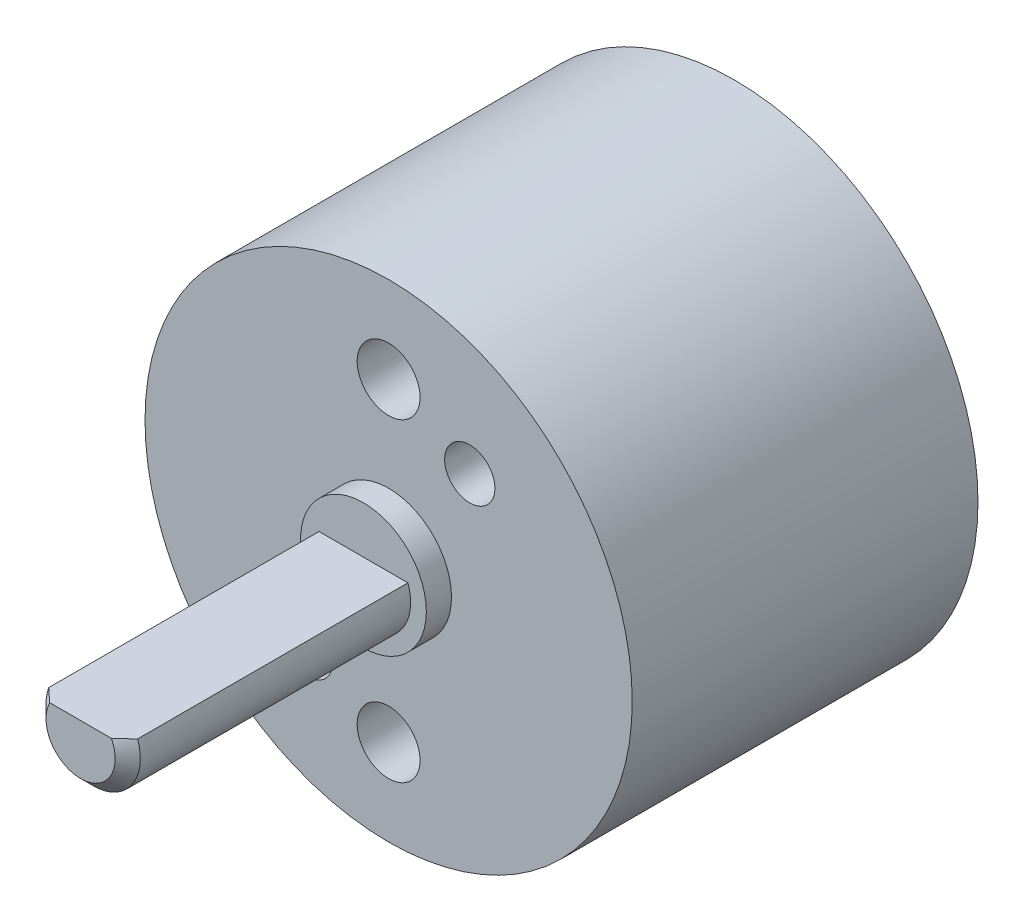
ISO-10303-21;
HEADER;
FILE_DESCRIPTION(('STEP AP214'),'2;1');
FILE_NAME('part.step','',(''),(''),'','','');
FILE_SCHEMA(('AUTOMOTIVE_DESIGN { 1 0 10303 214 1 1 1 1 }'));
ENDSEC;
DATA;
#1=APPLICATION_CONTEXT('core data for automotive mechanical design processes');
#2=APPLICATION_PROTOCOL_DEFINITION('international standard','automotive_design',2000,#1);
#3=PRODUCT_CONTEXT('',#1,'mechanical');
#4=PRODUCT('Part','Part','',(#3));
#5=PRODUCT_RELATED_PRODUCT_CATEGORY('part','',(#4));
#6=PRODUCT_DEFINITION_FORMATION('','',#4);
#7=PRODUCT_DEFINITION_CONTEXT('part definition',#1,'design');
#8=PRODUCT_DEFINITION('design','',#6,#7);
#9=PRODUCT_DEFINITION_SHAPE('','',#8);
#10=(LENGTH_UNIT() NAMED_UNIT(*) SI_UNIT(.MILLI.,.METRE.));
#11=(NAMED_UNIT(*) PLANE_ANGLE_UNIT() SI_UNIT($,.RADIAN.));
#12=(NAMED_UNIT(*) SI_UNIT($,.STERADIAN.) SOLID_ANGLE_UNIT());
#13=UNCERTAINTY_MEASURE_WITH_UNIT(LENGTH_MEASURE(1.E-05),#10,'distance_accuracy_value','');
#14=(GEOMETRIC_REPRESENTATION_CONTEXT(3) GLOBAL_UNCERTAINTY_ASSIGNED_CONTEXT((#13)) GLOBAL_UNIT_ASSIGNED_CONTEXT((#10,
#11,#12)) REPRESENTATION_CONTEXT('',''));
#15=CARTESIAN_POINT('',(0.,0.,0.));
#16=DIRECTION('',(0.,0.,1.));
#17=DIRECTION('',(1.,0.,0.));
#18=AXIS2_PLACEMENT_3D('',#15,#16,#17);
#19=CARTESIAN_POINT('',(0.,0.,11.));
#20=DIRECTION('',(0.,0.,-1.));
#21=DIRECTION('',(-1.,0.,0.));
#22=AXIS2_PLACEMENT_3D('',#19,#20,#21);
#23=CYLINDRICAL_SURFACE('',#22,7.75);
#24=CARTESIAN_POINT('',(0.,0.,11.));
#25=DIRECTION('',(0.,0.,1.));
#26=DIRECTION('',(1.,0.,0.));
#27=AXIS2_PLACEMENT_3D('',#24,#25,#26);
#28=CIRCLE('',#27,7.75);
#29=CARTESIAN_POINT('',(7.75,0.,11.));
#30=VERTEX_POINT('',#29);
#31=EDGE_CURVE('E112',#30,#30,#28,.T.);
#32=ORIENTED_EDGE('',*,*,#31,.F.);
#33=EDGE_LOOP('',(#32));
#34=FACE_BOUND('',#33,.T.);
#35=CARTESIAN_POINT('',(0.,0.,0.));
#36=DIRECTION('',(0.,0.,1.));
#37=DIRECTION('',(1.,0.,0.));
#38=AXIS2_PLACEMENT_3D('',#35,#36,#37);
#39=CIRCLE('',#38,7.75);
#40=CARTESIAN_POINT('',(7.75,0.,0.));
#41=VERTEX_POINT('',#40);
#42=EDGE_CURVE('E109',#41,#41,#39,.T.);
#43=ORIENTED_EDGE('',*,*,#42,.T.);
#44=EDGE_LOOP('',(#43));
#45=FACE_BOUND('',#44,.T.);
#46=ADVANCED_FACE('F18',(#34,#45),#23,.T.);
#47=CARTESIAN_POINT('',(0.,0.,11.));
#48=DIRECTION('',(0.,0.,1.));
#49=DIRECTION('',(1.,0.,0.));
#50=AXIS2_PLACEMENT_3D('',#47,#48,#49);
#51=PLANE('',#50);
#52=CARTESIAN_POINT('',(2.58109396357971,3.68618419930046,11.));
#53=DIRECTION('',(0.,0.,1.));
#54=DIRECTION('',(1.,0.,0.));
#55=AXIS2_PLACEMENT_3D('',#52,#53,#54);
#56=CIRCLE('',#55,0.79999999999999);
#57=CARTESIAN_POINT('',(3.3810939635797,3.68618419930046,11.));
#58=VERTEX_POINT('',#57);
#59=EDGE_CURVE('E71',#58,#58,#56,.T.);
#60=ORIENTED_EDGE('',*,*,#59,.F.);
#61=EDGE_LOOP('',(#60));
#62=FACE_BOUND('',#61,.T.);
#63=CARTESIAN_POINT('',(-2.58109396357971,-3.68618419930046,11.));
#64=DIRECTION('',(0.,0.,1.));
#65=DIRECTION('',(1.,0.,0.));
#66=AXIS2_PLACEMENT_3D('',#63,#64,#65);
#67=CIRCLE('',#66,0.79999999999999);
#68=CARTESIAN_POINT('',(-1.78109396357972,-3.68618419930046,11.));
#69=VERTEX_POINT('',#68);
#70=EDGE_CURVE('E70',#69,#69,#67,.T.);
#71=ORIENTED_EDGE('',*,*,#70,.F.);
#72=EDGE_LOOP('',(#71));
#73=FACE_BOUND('',#72,.T.);
#74=CARTESIAN_POINT('',(0.,-5.,11.));
#75=DIRECTION('',(0.,0.,1.));
#76=DIRECTION('',(1.,0.,0.));
#77=AXIS2_PLACEMENT_3D('',#74,#75,#76);
#78=CIRCLE('',#77,1.);
#79=CARTESIAN_POINT('',(1.,-5.,11.));
#80=VERTEX_POINT('',#79);
#81=EDGE_CURVE('E83',#80,#80,#78,.T.);
#82=ORIENTED_EDGE('',*,*,#81,.F.);
#83=EDGE_LOOP('',(#82));
#84=FACE_BOUND('',#83,.T.);
#85=CARTESIAN_POINT('',(0.,5.,11.));
#86=DIRECTION('',(0.,0.,1.));
#87=DIRECTION('',(1.,0.,0.));
#88=AXIS2_PLACEMENT_3D('',#85,#86,#87);
#89=CIRCLE('',#88,1.);
#90=CARTESIAN_POINT('',(0.999999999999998,5.,11.));
#91=VERTEX_POINT('',#90);
#92=EDGE_CURVE('E87',#91,#91,#89,.T.);
#93=ORIENTED_EDGE('',*,*,#92,.F.);
#94=EDGE_LOOP('',(#93));
#95=FACE_BOUND('',#94,.T.);
#96=CARTESIAN_POINT('',(0.,0.,11.));
#97=DIRECTION('',(0.,0.,1.));
#98=DIRECTION('',(1.,0.,0.));
#99=AXIS2_PLACEMENT_3D('',#96,#97,#98);
#100=CIRCLE('',#99,2.);
#101=CARTESIAN_POINT('',(2.,0.,11.));
#102=VERTEX_POINT('',#101);
#103=EDGE_CURVE('E105',#102,#102,#100,.T.);
#104=ORIENTED_EDGE('',*,*,#103,.F.);
#105=EDGE_LOOP('',(#104));
#106=FACE_BOUND('',#105,.T.);
#107=ORIENTED_EDGE('',*,*,#31,.T.);
#108=EDGE_LOOP('',(#107));
#109=FACE_BOUND('',#108,.T.);
#110=ADVANCED_FACE('F142',(#62,#73,#84,#95,#106,#109),#51,.T.);
#111=CARTESIAN_POINT('',(0.,0.,0.));
#112=DIRECTION('',(0.,0.,1.));
#113=DIRECTION('',(1.,0.,0.));
#114=AXIS2_PLACEMENT_3D('',#111,#112,#113);
#115=PLANE('',#114);
#116=CARTESIAN_POINT('',(0.,0.,0.));
#117=DIRECTION('',(0.,0.,-1.));
#118=DIRECTION('',(-1.,0.,0.));
#119=AXIS2_PLACEMENT_3D('',#116,#117,#118);
#120=CIRCLE('',#119,2.3);
#121=CARTESIAN_POINT('',(-2.3,0.,0.));
#122=VERTEX_POINT('',#121);
#123=EDGE_CURVE('E735',#122,#122,#120,.T.);
#124=ORIENTED_EDGE('',*,*,#123,.F.);
#125=EDGE_LOOP('',(#124));
#126=FACE_BOUND('',#125,.T.);
#127=CARTESIAN_POINT('',(0.,-5.,0.));
#128=DIRECTION('',(0.,0.,1.));
#129=DIRECTION('',(1.,0.,0.));
#130=AXIS2_PLACEMENT_3D('',#127,#128,#129);
#131=CIRCLE('',#130,1.);
#132=CARTESIAN_POINT('',(1.,-5.,0.));
#133=VERTEX_POINT('',#132);
#134=EDGE_CURVE('E84',#133,#133,#131,.T.);
#135=ORIENTED_EDGE('',*,*,#134,.T.);
#136=EDGE_LOOP('',(#135));
#137=FACE_BOUND('',#136,.T.);
#138=CARTESIAN_POINT('',(0.,5.,0.));
#139=DIRECTION('',(0.,0.,1.));
#140=DIRECTION('',(1.,0.,0.));
#141=AXIS2_PLACEMENT_3D('',#138,#139,#140);
#142=CIRCLE('',#141,1.);
#143=CARTESIAN_POINT('',(0.999999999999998,5.,0.));
#144=VERTEX_POINT('',#143);
#145=EDGE_CURVE('E90',#144,#144,#142,.T.);
#146=ORIENTED_EDGE('',*,*,#145,.T.);
#147=EDGE_LOOP('',(#146));
#148=FACE_BOUND('',#147,.T.);
#149=ORIENTED_EDGE('',*,*,#42,.F.);
#150=EDGE_LOOP('',(#149));
#151=FACE_BOUND('',#150,.T.);
#152=ADVANCED_FACE('F148',(#126,#137,#148,#151),#115,.F.);
#153=CARTESIAN_POINT('',(0.,0.,11.8));
#154=DIRECTION('',(0.,0.,-1.));
#155=DIRECTION('',(-1.,0.,0.));
#156=AXIS2_PLACEMENT_3D('',#153,#154,#155);
#157=CYLINDRICAL_SURFACE('',#156,2.);
#158=CARTESIAN_POINT('',(0.,0.,11.8));
#159=DIRECTION('',(0.,0.,1.));
#160=DIRECTION('',(1.,0.,0.));
#161=AXIS2_PLACEMENT_3D('',#158,#159,#160);
#162=CIRCLE('',#161,2.);
#163=CARTESIAN_POINT('',(2.,0.,11.8));
#164=VERTEX_POINT('',#163);
#165=EDGE_CURVE('E106',#164,#164,#162,.T.);
#166=ORIENTED_EDGE('',*,*,#165,.F.);
#167=EDGE_LOOP('',(#166));
#168=FACE_BOUND('',#167,.T.);
#169=ORIENTED_EDGE('',*,*,#103,.T.);
#170=EDGE_LOOP('',(#169));
#171=FACE_BOUND('',#170,.T.);
#172=ADVANCED_FACE('F155',(#168,#171),#157,.T.);
#173=CARTESIAN_POINT('',(0.,0.,11.8));
#174=DIRECTION('',(0.,0.,1.));
#175=DIRECTION('',(1.,0.,0.));
#176=AXIS2_PLACEMENT_3D('',#173,#174,#175);
#177=PLANE('',#176);
#178=CARTESIAN_POINT('',(0.,0.,11.8));
#179=DIRECTION('',(0.,0.,1.));
#180=DIRECTION('',(1.,0.,0.));
#181=AXIS2_PLACEMENT_3D('',#178,#179,#180);
#182=CIRCLE('',#181,1.5);
#183=CARTESIAN_POINT('',(-1.41421356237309,0.5,11.8));
#184=VERTEX_POINT('',#183);
#185=CARTESIAN_POINT('',(1.41421356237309,0.5,11.8));
#186=VERTEX_POINT('',#185);
#187=EDGE_CURVE('E102',#184,#186,#182,.T.);
#188=ORIENTED_EDGE('',*,*,#187,.F.);
#189=DIRECTION('',(-1.,0.,0.));
#190=VECTOR('',#189,1.);
#191=CARTESIAN_POINT('',(-2.24988252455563,0.5,11.8));
#192=LINE('',#191,#190);
#193=EDGE_CURVE('E96',#186,#184,#192,.T.);
#194=ORIENTED_EDGE('',*,*,#193,.F.);
#195=EDGE_LOOP('',(#188,#194));
#196=FACE_BOUND('',#195,.T.);
#197=ORIENTED_EDGE('',*,*,#165,.T.);
#198=EDGE_LOOP('',(#197));
#199=FACE_BOUND('',#198,.T.);
#200=ADVANCED_FACE('F139',(#196,#199),#177,.T.);
#201=CARTESIAN_POINT('',(0.,0.,20.8));
#202=DIRECTION('',(0.,0.,-1.));
#203=DIRECTION('',(-1.,0.,0.));
#204=AXIS2_PLACEMENT_3D('',#201,#202,#203);
#205=CYLINDRICAL_SURFACE('',#204,1.5);
#206=CARTESIAN_POINT('',(0.,0.,20.4));
#207=DIRECTION('',(0.,0.,1.));
#208=DIRECTION('',(1.,0.,0.));
#209=AXIS2_PLACEMENT_3D('',#206,#207,#208);
#210=CIRCLE('',#209,1.5);
#211=CARTESIAN_POINT('',(1.4142135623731,0.5,20.4));
#212=VERTEX_POINT('',#211);
#213=CARTESIAN_POINT('',(-1.41421356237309,0.5,20.4));
#214=VERTEX_POINT('',#213);
#215=EDGE_CURVE('E119',#212,#214,#210,.F.);
#216=ORIENTED_EDGE('',*,*,#215,.T.);
#217=DIRECTION('',(0.,0.,-1.));
#218=VECTOR('',#217,1.);
#219=CARTESIAN_POINT('',(-1.41421356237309,0.5,20.8));
#220=LINE('',#219,#218);
#221=EDGE_CURVE('E43',#214,#184,#220,.T.);
#222=ORIENTED_EDGE('',*,*,#221,.T.);
#223=ORIENTED_EDGE('',*,*,#187,.T.);
#224=DIRECTION('',(0.,0.,-1.));
#225=VECTOR('',#224,1.);
#226=CARTESIAN_POINT('',(1.41421356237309,0.5,20.8));
#227=LINE('',#226,#225);
#228=EDGE_CURVE('E98',#186,#212,#227,.F.);
#229=ORIENTED_EDGE('',*,*,#228,.T.);
#230=EDGE_LOOP('',(#216,#222,#223,#229));
#231=FACE_BOUND('',#230,.T.);
#232=ADVANCED_FACE('F127',(#231),#205,.T.);
#233=CARTESIAN_POINT('',(0.,0.,20.8));
#234=DIRECTION('',(0.,0.,1.));
#235=DIRECTION('',(1.,0.,0.));
#236=AXIS2_PLACEMENT_3D('',#233,#234,#235);
#237=PLANE('',#236);
#238=DIRECTION('',(1.,0.,0.));
#239=VECTOR('',#238,1.);
#240=CARTESIAN_POINT('',(-2.24988252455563,0.5,20.8));
#241=LINE('',#240,#239);
#242=CARTESIAN_POINT('',(-0.979795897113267,0.5,20.8));
#243=VERTEX_POINT('',#242);
#244=CARTESIAN_POINT('',(0.979795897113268,0.5,20.8));
#245=VERTEX_POINT('',#244);
#246=EDGE_CURVE('E37',#243,#245,#241,.T.);
#247=ORIENTED_EDGE('',*,*,#246,.F.);
#248=CARTESIAN_POINT('',(0.,0.,20.8));
#249=DIRECTION('',(0.,0.,1.));
#250=DIRECTION('',(1.,0.,0.));
#251=AXIS2_PLACEMENT_3D('',#248,#249,#250);
#252=CIRCLE('',#251,1.1);
#253=EDGE_CURVE('E115',#243,#245,#252,.T.);
#254=ORIENTED_EDGE('',*,*,#253,.T.);
#255=EDGE_LOOP('',(#247,#254));
#256=FACE_BOUND('',#255,.T.);
#257=ADVANCED_FACE('F130',(#256),#237,.T.);
#258=CARTESIAN_POINT('',(0.,0.,20.8));
#259=DIRECTION('',(0.,0.,-1.));
#260=DIRECTION('',(-1.,0.,0.));
#261=AXIS2_PLACEMENT_3D('',#258,#259,#260);
#262=CONICAL_SURFACE('',#261,1.1,0.785398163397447);
#263=CARTESIAN_POINT('',(-3.27821825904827,0.5,18.5838704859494));
#264=CARTESIAN_POINT('',(-3.18221939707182,0.5,18.6787674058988));
#265=CARTESIAN_POINT('',(-3.08617740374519,0.5,18.7736207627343));
#266=CARTESIAN_POINT('',(-2.89391220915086,0.5,18.9632553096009));
#267=CARTESIAN_POINT('',(-2.79768893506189,0.5,19.0580364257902));
#268=CARTESIAN_POINT('',(-2.6040290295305,0.5,19.2484622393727));
#269=CARTESIAN_POINT('',(-2.50659059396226,0.5,19.3441051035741));
#270=CARTESIAN_POINT('',(-2.31153138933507,0.5,19.5350921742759));
#271=CARTESIAN_POINT('',(-2.21391075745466,0.5,19.6304365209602));
#272=CARTESIAN_POINT('',(-1.98061529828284,0.5,19.8574924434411));
#273=CARTESIAN_POINT('',(-1.84478627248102,0.5,19.989046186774));
#274=CARTESIAN_POINT('',(-1.64000448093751,0.5,20.1855739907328));
#275=CARTESIAN_POINT('',(-1.57150069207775,0.5,20.2510155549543));
#276=CARTESIAN_POINT('',(-1.43406909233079,0.5,20.3814223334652));
#277=CARTESIAN_POINT('',(-1.36514137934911,0.5,20.4463876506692));
#278=CARTESIAN_POINT('',(-1.22721945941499,0.5,20.5750633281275));
#279=CARTESIAN_POINT('',(-1.15823083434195,0.5,20.6387796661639));
#280=CARTESIAN_POINT('',(-1.01917842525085,0.5,20.7651587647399));
#281=CARTESIAN_POINT('',(-0.949113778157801,0.5,20.8278205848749));
#282=CARTESIAN_POINT('',(-0.8428223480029,0.5,20.920178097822));
#283=CARTESIAN_POINT('',(-0.807259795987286,0.5,20.9506364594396));
#284=CARTESIAN_POINT('',(-0.735530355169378,0.5,21.0108311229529));
#285=CARTESIAN_POINT('',(-0.699363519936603,0.5,21.0405674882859));
#286=CARTESIAN_POINT('',(-0.626235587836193,0.5,21.0989467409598));
#287=CARTESIAN_POINT('',(-0.589275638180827,0.5,21.1275910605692));
#288=CARTESIAN_POINT('',(-0.514159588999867,0.5,21.1832584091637));
#289=CARTESIAN_POINT('',(-0.476004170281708,0.5,21.2102823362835));
#290=CARTESIAN_POINT('',(-0.427173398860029,0.5,21.2424104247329));
#291=CARTESIAN_POINT('',(-0.417323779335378,0.5,21.2487701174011));
#292=CARTESIAN_POINT('',(-0.397499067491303,0.5,21.2612933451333));
#293=CARTESIAN_POINT('',(-0.387523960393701,0.5,21.2674568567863));
#294=CARTESIAN_POINT('',(-0.35739220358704,0.5,21.2856127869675));
#295=CARTESIAN_POINT('',(-0.337030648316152,0.5,21.2972695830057));
#296=CARTESIAN_POINT('',(-0.295822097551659,0.5,21.3193021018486));
#297=CARTESIAN_POINT('',(-0.274980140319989,0.5,21.3296871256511));
#298=CARTESIAN_POINT('',(-0.232583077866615,0.5,21.3488761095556));
#299=CARTESIAN_POINT('',(-0.211028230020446,0.5,21.3576806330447));
#300=CARTESIAN_POINT('',(-0.159872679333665,0.5,21.3757725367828));
#301=CARTESIAN_POINT('',(-0.129971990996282,0.5,21.3842537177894));
#302=CARTESIAN_POINT('',(-0.069235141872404,0.5,21.3960976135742));
#303=CARTESIAN_POINT('',(-0.038403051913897,0.5,21.3994800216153));
#304=CARTESIAN_POINT('',(0.0234979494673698,0.5,21.4004089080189));
#305=CARTESIAN_POINT('',(0.0545672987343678,0.5,21.3979285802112));
#306=CARTESIAN_POINT('',(0.115861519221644,0.5,21.3876524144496));
#307=CARTESIAN_POINT('',(0.146083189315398,0.5,21.3798386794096));
#308=CARTESIAN_POINT('',(0.206509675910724,0.5,21.359821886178));
#309=CARTESIAN_POINT('',(0.236650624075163,0.5,21.3474345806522));
#310=CARTESIAN_POINT('',(0.295586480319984,0.5,21.3197475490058));
#311=CARTESIAN_POINT('',(0.324378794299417,0.5,21.3044424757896));
#312=CARTESIAN_POINT('',(0.381056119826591,0.5,21.2717771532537));
#313=CARTESIAN_POINT('',(0.408932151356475,0.5,21.2544016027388));
#314=CARTESIAN_POINT('',(0.463776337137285,0.5,21.2183380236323));
#315=CARTESIAN_POINT('',(0.490745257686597,0.5,21.1996511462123));
#316=CARTESIAN_POINT('',(0.546349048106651,0.5,21.1596677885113));
#317=CARTESIAN_POINT('',(0.574922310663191,0.5,21.1382862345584));
#318=CARTESIAN_POINT('',(0.631472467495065,0.5,21.0947458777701));
#319=CARTESIAN_POINT('',(0.65944928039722,0.5,21.072586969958));
#320=CARTESIAN_POINT('',(0.742730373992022,0.5,21.0052547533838));
#321=CARTESIAN_POINT('',(0.797357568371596,0.5,20.9592465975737));
#322=CARTESIAN_POINT('',(0.905609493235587,0.5,20.8658871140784));
#323=CARTESIAN_POINT('',(0.959232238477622,0.5,20.8185335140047));
#324=CARTESIAN_POINT('',(1.06573952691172,0.5,20.7230354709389));
#325=CARTESIAN_POINT('',(1.11862427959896,0.5,20.6748912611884));
#326=CARTESIAN_POINT('',(1.22374017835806,0.5,20.5782143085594));
#327=CARTESIAN_POINT('',(1.27597281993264,0.5,20.5296831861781));
#328=CARTESIAN_POINT('',(1.38008995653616,0.5,20.4322418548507));
#329=CARTESIAN_POINT('',(1.43197442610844,0.5,20.383331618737));
#330=CARTESIAN_POINT('',(1.58714057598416,0.5,20.2362954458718));
#331=CARTESIAN_POINT('',(1.69004003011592,0.5,20.1377665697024));
#332=CARTESIAN_POINT('',(1.91746445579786,0.5,19.9186980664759));
#333=CARTESIAN_POINT('',(2.04184774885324,0.5,19.7980118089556));
#334=CARTESIAN_POINT('',(2.29014609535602,0.5,19.5560720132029));
#335=CARTESIAN_POINT('',(2.41406096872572,0.5,19.4348182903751));
#336=CARTESIAN_POINT('',(2.6614956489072,0.5,19.1920516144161));
#337=CARTESIAN_POINT('',(2.78501564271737,0.5,19.0705388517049));
#338=CARTESIAN_POINT('',(3.03178449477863,0.5,18.827329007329));
#339=CARTESIAN_POINT('',(3.15503343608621,0.5,18.7056320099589));
#340=CARTESIAN_POINT('',(3.27821825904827,0.5,18.5838704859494));
#341=B_SPLINE_CURVE_WITH_KNOTS('',3,(#263,#264,#265,#266,#267,#268,#269,#270,#271,#272,#273,
#274,#275,#276,#277,#278,#279,#280,#281,#282,#283,#284,#285,#286,#287,#288,#289,#290,#291,#292,
#293,#294,#295,#296,#297,#298,#299,#300,#301,#302,#303,#304,#305,#306,#307,#308,#309,#310,#311,
#312,#313,#314,#315,#316,#317,#318,#319,#320,#321,#322,#323,#324,#325,#326,#327,#328,#329,#330,
#331,#332,#333,#334,#335,#336,#337,#338,#339,#340),.UNSPECIFIED.,.F.,.F.,(4,2,2,2,2,2,2,2,2,2,2,
2,2,2,2,2,2,2,2,2,2,2,2,2,2,2,2,2,2,2,2,2,2,2,2,2,2,2,4),(0.,0.404957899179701,
0.810150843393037,1.21975542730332,1.62912431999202,2.19639581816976,2.48060984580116,
2.76476052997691,3.04648753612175,3.32845372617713,3.46891717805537,3.60936824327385,
3.74962827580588,3.88980983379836,3.92498088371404,3.96015611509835,4.03051208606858,
4.10031813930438,4.17009925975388,4.26299609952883,4.35553321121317,4.44849424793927,
4.54176877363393,4.63930528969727,4.73702229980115,4.83551237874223,4.9339170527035,
5.04096097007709,5.14801939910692,5.36223990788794,5.57684669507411,5.79139126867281,
6.00528538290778,6.21919496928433,6.64658428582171,7.16651222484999,7.68662303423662,
8.2064331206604,8.72605189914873),.UNSPECIFIED.);
#342=EDGE_CURVE('E11',#214,#243,#341,.T.);
#343=ORIENTED_EDGE('',*,*,#342,.F.);
#344=ORIENTED_EDGE('',*,*,#215,.F.);
#345=EDGE_CURVE('E23',#245,#212,#341,.T.);
#346=ORIENTED_EDGE('',*,*,#345,.F.);
#347=ORIENTED_EDGE('',*,*,#253,.F.);
#348=EDGE_LOOP('',(#343,#344,#346,#347));
#349=FACE_BOUND('',#348,.T.);
#350=ADVANCED_FACE('F20',(#349),#262,.T.);
#351=CARTESIAN_POINT('',(-2.24988252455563,0.5,5.481995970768));
#352=DIRECTION('',(0.,-1.,0.));
#353=DIRECTION('',(0.,0.,-1.));
#354=AXIS2_PLACEMENT_3D('',#351,#352,#353);
#355=PLANE('',#354);
#356=ORIENTED_EDGE('',*,*,#342,.T.);
#357=ORIENTED_EDGE('',*,*,#246,.T.);
#358=ORIENTED_EDGE('',*,*,#345,.T.);
#359=ORIENTED_EDGE('',*,*,#228,.F.);
#360=ORIENTED_EDGE('',*,*,#193,.T.);
#361=ORIENTED_EDGE('',*,*,#221,.F.);
#362=EDGE_LOOP('',(#356,#357,#358,#359,#360,#361));
#363=FACE_BOUND('',#362,.T.);
#364=ADVANCED_FACE('F123',(#363),#355,.F.);
#365=CARTESIAN_POINT('',(0.,5.,0.));
#366=DIRECTION('',(0.,0.,1.));
#367=DIRECTION('',(1.,0.,0.));
#368=AXIS2_PLACEMENT_3D('',#365,#366,#367);
#369=CYLINDRICAL_SURFACE('',#368,1.);
#370=ORIENTED_EDGE('',*,*,#145,.F.);
#371=EDGE_LOOP('',(#370));
#372=FACE_BOUND('',#371,.T.);
#373=ORIENTED_EDGE('',*,*,#92,.T.);
#374=EDGE_LOOP('',(#373));
#375=FACE_BOUND('',#374,.T.);
#376=ADVANCED_FACE('F211',(#372,#375),#369,.F.);
#377=CARTESIAN_POINT('',(0.,-5.,0.));
#378=DIRECTION('',(0.,0.,1.));
#379=DIRECTION('',(1.,0.,0.));
#380=AXIS2_PLACEMENT_3D('',#377,#378,#379);
#381=CYLINDRICAL_SURFACE('',#380,1.);
#382=ORIENTED_EDGE('',*,*,#134,.F.);
#383=EDGE_LOOP('',(#382));
#384=FACE_BOUND('',#383,.T.);
#385=ORIENTED_EDGE('',*,*,#81,.T.);
#386=EDGE_LOOP('',(#385));
#387=FACE_BOUND('',#386,.T.);
#388=ADVANCED_FACE('F221',(#384,#387),#381,.F.);
#389=CARTESIAN_POINT('',(-2.58109396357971,-3.68618419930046,5.));
#390=DIRECTION('',(0.,0.,1.));
#391=DIRECTION('',(1.,0.,0.));
#392=AXIS2_PLACEMENT_3D('',#389,#390,#391);
#393=CONICAL_SURFACE('',#392,0.799999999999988,1.02974425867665);
#394=CARTESIAN_POINT('',(-2.58109396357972,-3.68618419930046,4.51931150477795));
#395=VERTEX_POINT('',#394);
#396=VERTEX_LOOP('',#395);
#397=FACE_BOUND('',#396,.T.);
#398=CARTESIAN_POINT('',(-2.58109396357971,-3.68618419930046,5.));
#399=DIRECTION('',(0.,0.,1.));
#400=DIRECTION('',(1.,0.,0.));
#401=AXIS2_PLACEMENT_3D('',#398,#399,#400);
#402=CIRCLE('',#401,0.799999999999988);
#403=CARTESIAN_POINT('',(-1.78109396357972,-3.68618419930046,5.));
#404=VERTEX_POINT('',#403);
#405=EDGE_CURVE('E74',#404,#404,#402,.T.);
#406=ORIENTED_EDGE('',*,*,#405,.T.);
#407=EDGE_LOOP('',(#406));
#408=FACE_BOUND('',#407,.T.);
#409=ADVANCED_FACE('F233',(#397,#408),#393,.F.);
#410=CARTESIAN_POINT('',(-2.58109396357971,-3.68618419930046,11.));
#411=DIRECTION('',(0.,0.,1.));
#412=DIRECTION('',(1.,0.,0.));
#413=AXIS2_PLACEMENT_3D('',#410,#411,#412);
#414=CYLINDRICAL_SURFACE('',#413,0.799999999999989);
#415=ORIENTED_EDGE('',*,*,#405,.F.);
#416=EDGE_LOOP('',(#415));
#417=FACE_BOUND('',#416,.T.);
#418=ORIENTED_EDGE('',*,*,#70,.T.);
#419=EDGE_LOOP('',(#418));
#420=FACE_BOUND('',#419,.T.);
#421=ADVANCED_FACE('F64',(#417,#420),#414,.F.);
#422=CARTESIAN_POINT('',(2.58109396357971,3.68618419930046,5.));
#423=DIRECTION('',(0.,0.,1.));
#424=DIRECTION('',(1.,0.,0.));
#425=AXIS2_PLACEMENT_3D('',#422,#423,#424);
#426=CONICAL_SURFACE('',#425,0.799999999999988,1.02974425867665);
#427=CARTESIAN_POINT('',(2.58109396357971,3.68618419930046,4.51931150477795));
#428=VERTEX_POINT('',#427);
#429=VERTEX_LOOP('',#428);
#430=FACE_BOUND('',#429,.T.);
#431=CARTESIAN_POINT('',(2.58109396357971,3.68618419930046,5.));
#432=DIRECTION('',(0.,0.,1.));
#433=DIRECTION('',(1.,0.,0.));
#434=AXIS2_PLACEMENT_3D('',#431,#432,#433);
#435=CIRCLE('',#434,0.799999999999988);
#436=CARTESIAN_POINT('',(3.3810939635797,3.68618419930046,5.));
#437=VERTEX_POINT('',#436);
#438=EDGE_CURVE('E68',#437,#437,#435,.T.);
#439=ORIENTED_EDGE('',*,*,#438,.T.);
#440=EDGE_LOOP('',(#439));
#441=FACE_BOUND('',#440,.T.);
#442=ADVANCED_FACE('F60',(#430,#441),#426,.F.);
#443=CARTESIAN_POINT('',(2.58109396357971,3.68618419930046,11.));
#444=DIRECTION('',(0.,0.,1.));
#445=DIRECTION('',(1.,0.,0.));
#446=AXIS2_PLACEMENT_3D('',#443,#444,#445);
#447=CYLINDRICAL_SURFACE('',#446,0.799999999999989);
#448=ORIENTED_EDGE('',*,*,#438,.F.);
#449=EDGE_LOOP('',(#448));
#450=FACE_BOUND('',#449,.T.);
#451=ORIENTED_EDGE('',*,*,#59,.T.);
#452=EDGE_LOOP('',(#451));
#453=FACE_BOUND('',#452,.T.);
#454=ADVANCED_FACE('F63',(#450,#453),#447,.F.);
#455=CARTESIAN_POINT('',(0.,0.,3.));
#456=DIRECTION('',(0.,0.,-1.));
#457=DIRECTION('',(-1.,0.,0.));
#458=AXIS2_PLACEMENT_3D('',#455,#456,#457);
#459=CYLINDRICAL_SURFACE('',#458,2.3);
#460=CARTESIAN_POINT('',(0.,0.,3.));
#461=DIRECTION('',(0.,0.,-1.));
#462=DIRECTION('',(-1.,0.,0.));
#463=AXIS2_PLACEMENT_3D('',#460,#461,#462);
#464=CIRCLE('',#463,2.3);
#465=CARTESIAN_POINT('',(-2.3,0.,3.));
#466=VERTEX_POINT('',#465);
#467=EDGE_CURVE('E77',#466,#466,#464,.T.);
#468=ORIENTED_EDGE('',*,*,#467,.F.);
#469=EDGE_LOOP('',(#468));
#470=FACE_BOUND('',#469,.T.);
#471=ORIENTED_EDGE('',*,*,#123,.T.);
#472=EDGE_LOOP('',(#471));
#473=FACE_BOUND('',#472,.T.);
#474=ADVANCED_FACE('F262',(#470,#473),#459,.F.);
#475=CARTESIAN_POINT('',(0.,0.,3.));
#476=DIRECTION('',(0.,0.,-1.));
#477=DIRECTION('',(-1.,0.,0.));
#478=AXIS2_PLACEMENT_3D('',#475,#476,#477);
#479=PLANE('',#478);
#480=ORIENTED_EDGE('',*,*,#467,.T.);
#481=EDGE_LOOP('',(#480));
#482=FACE_BOUND('',#481,.T.);
#483=ADVANCED_FACE('F267',(#482),#479,.T.);
#484=CLOSED_SHELL('',(#46,#110,#152,#172,#200,#232,#257,#350,#364,#376,#388,#409,#421,#442,#454,
#474,#483));
#485=MANIFOLD_SOLID_BREP('B1',#484);
#486=ADVANCED_BREP_SHAPE_REPRESENTATION('',(#18,#485),#14);
#487=SHAPE_DEFINITION_REPRESENTATION(#9,#486);
ENDSEC;
END-ISO-10303-21;
